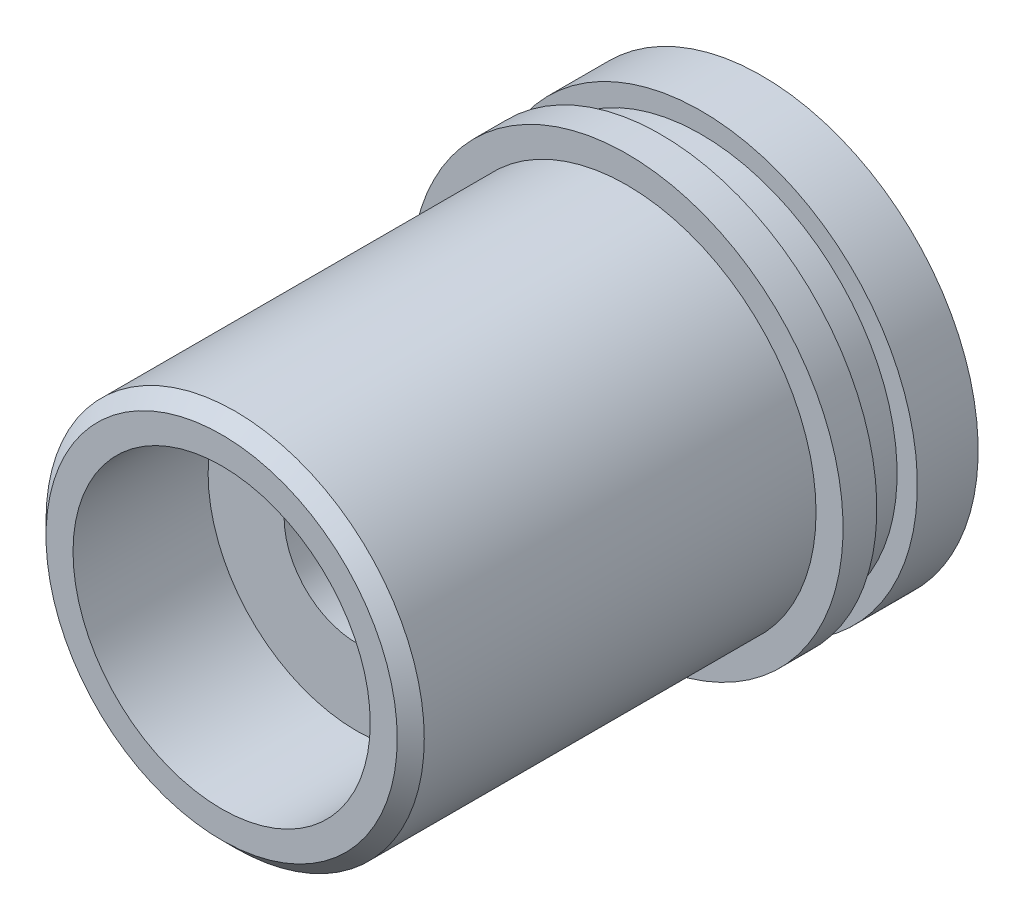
ISO-10303-21;
HEADER;
FILE_DESCRIPTION(('STEP AP214'),'2;1');
FILE_NAME('part.step','',(''),(''),'','','');
FILE_SCHEMA(('AUTOMOTIVE_DESIGN { 1 0 10303 214 1 1 1 1 }'));
ENDSEC;
DATA;
#1=APPLICATION_CONTEXT('core data for automotive mechanical design processes');
#2=APPLICATION_PROTOCOL_DEFINITION('international standard','automotive_design',2000,#1);
#3=PRODUCT_CONTEXT('',#1,'mechanical');
#4=PRODUCT('Part','Part','',(#3));
#5=PRODUCT_RELATED_PRODUCT_CATEGORY('part','',(#4));
#6=PRODUCT_DEFINITION_FORMATION('','',#4);
#7=PRODUCT_DEFINITION_CONTEXT('part definition',#1,'design');
#8=PRODUCT_DEFINITION('design','',#6,#7);
#9=PRODUCT_DEFINITION_SHAPE('','',#8);
#10=(LENGTH_UNIT() NAMED_UNIT(*) SI_UNIT(.MILLI.,.METRE.));
#11=(NAMED_UNIT(*) PLANE_ANGLE_UNIT() SI_UNIT($,.RADIAN.));
#12=(NAMED_UNIT(*) SI_UNIT($,.STERADIAN.) SOLID_ANGLE_UNIT());
#13=UNCERTAINTY_MEASURE_WITH_UNIT(LENGTH_MEASURE(1.E-05),#10,'distance_accuracy_value','');
#14=(GEOMETRIC_REPRESENTATION_CONTEXT(3) GLOBAL_UNCERTAINTY_ASSIGNED_CONTEXT((#13)) GLOBAL_UNIT_ASSIGNED_CONTEXT((#10,
#11,#12)) REPRESENTATION_CONTEXT('',''));
#15=CARTESIAN_POINT('',(0.,0.,0.));
#16=DIRECTION('',(0.,0.,1.));
#17=DIRECTION('',(1.,0.,0.));
#18=AXIS2_PLACEMENT_3D('',#15,#16,#17);
#19=CARTESIAN_POINT('',(0.,0.,20.));
#20=DIRECTION('',(0.,0.,-1.));
#21=DIRECTION('',(-1.,0.,0.));
#22=AXIS2_PLACEMENT_3D('',#19,#20,#21);
#23=CONICAL_SURFACE('',#22,5.37534009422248,0.08726646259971);
#24=CARTESIAN_POINT('',(0.,0.,-10.));
#25=DIRECTION('',(0.,0.,-1.));
#26=DIRECTION('',(-1.,0.,0.));
#27=AXIS2_PLACEMENT_3D('',#24,#25,#26);
#28=CIRCLE('',#27,8.);
#29=CARTESIAN_POINT('',(-8.,0.,-10.));
#30=VERTEX_POINT('',#29);
#31=EDGE_CURVE('E49',#30,#30,#28,.T.);
#32=ORIENTED_EDGE('',*,*,#31,.T.);
#33=EDGE_LOOP('',(#32));
#34=FACE_BOUND('',#33,.T.);
#35=CARTESIAN_POINT('',(0.,0.,20.));
#36=DIRECTION('',(0.,0.,-1.));
#37=DIRECTION('',(-1.,0.,0.));
#38=AXIS2_PLACEMENT_3D('',#35,#36,#37);
#39=CIRCLE('',#38,5.37534009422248);
#40=CARTESIAN_POINT('',(-5.37534009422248,0.,20.));
#41=VERTEX_POINT('',#40);
#42=EDGE_CURVE('E82',#41,#41,#39,.T.);
#43=ORIENTED_EDGE('',*,*,#42,.F.);
#44=EDGE_LOOP('',(#43));
#45=FACE_BOUND('',#44,.T.);
#46=ADVANCED_FACE('F39',(#34,#45),#23,.F.);
#47=CARTESIAN_POINT('',(-8.,0.,-10.));
#48=DIRECTION('',(0.,0.,-1.));
#49=DIRECTION('',(-1.,0.,0.));
#50=AXIS2_PLACEMENT_3D('',#47,#48,#49);
#51=PLANE('',#50);
#52=CARTESIAN_POINT('',(0.,0.,-10.));
#53=DIRECTION('',(0.,0.,-1.));
#54=DIRECTION('',(-1.,0.,0.));
#55=AXIS2_PLACEMENT_3D('',#52,#53,#54);
#56=CIRCLE('',#55,16.);
#57=CARTESIAN_POINT('',(-16.,0.,-10.));
#58=VERTEX_POINT('',#57);
#59=EDGE_CURVE('E53',#58,#58,#56,.T.);
#60=ORIENTED_EDGE('',*,*,#59,.T.);
#61=EDGE_LOOP('',(#60));
#62=FACE_BOUND('',#61,.T.);
#63=ORIENTED_EDGE('',*,*,#31,.F.);
#64=EDGE_LOOP('',(#63));
#65=FACE_BOUND('',#64,.T.);
#66=ADVANCED_FACE('F90',(#62,#65),#51,.T.);
#67=CARTESIAN_POINT('',(0.,0.,-11.0873015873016));
#68=DIRECTION('',(0.,0.,-1.));
#69=DIRECTION('',(-1.,0.,0.));
#70=AXIS2_PLACEMENT_3D('',#67,#68,#69);
#71=CYLINDRICAL_SURFACE('',#70,16.);
#72=CARTESIAN_POINT('',(0.,0.,-5.5));
#73=DIRECTION('',(0.,0.,-1.));
#74=DIRECTION('',(-1.,0.,0.));
#75=AXIS2_PLACEMENT_3D('',#72,#73,#74);
#76=CIRCLE('',#75,16.);
#77=CARTESIAN_POINT('',(-16.,0.,-5.5));
#78=VERTEX_POINT('',#77);
#79=EDGE_CURVE('E58',#78,#78,#76,.T.);
#80=ORIENTED_EDGE('',*,*,#79,.T.);
#81=EDGE_LOOP('',(#80));
#82=FACE_BOUND('',#81,.T.);
#83=ORIENTED_EDGE('',*,*,#59,.F.);
#84=EDGE_LOOP('',(#83));
#85=FACE_BOUND('',#84,.T.);
#86=ADVANCED_FACE('F95',(#82,#85),#71,.T.);
#87=CARTESIAN_POINT('',(-16.,0.,-5.5));
#88=DIRECTION('',(0.,0.,1.));
#89=DIRECTION('',(1.,0.,0.));
#90=AXIS2_PLACEMENT_3D('',#87,#88,#89);
#91=PLANE('',#90);
#92=CARTESIAN_POINT('',(0.,0.,-5.5));
#93=DIRECTION('',(0.,0.,-1.));
#94=DIRECTION('',(-1.,0.,0.));
#95=AXIS2_PLACEMENT_3D('',#92,#93,#94);
#96=CIRCLE('',#95,14.5);
#97=CARTESIAN_POINT('',(-14.5,0.,-5.5));
#98=VERTEX_POINT('',#97);
#99=EDGE_CURVE('E61',#98,#98,#96,.T.);
#100=ORIENTED_EDGE('',*,*,#99,.T.);
#101=EDGE_LOOP('',(#100));
#102=FACE_BOUND('',#101,.T.);
#103=ORIENTED_EDGE('',*,*,#79,.F.);
#104=EDGE_LOOP('',(#103));
#105=FACE_BOUND('',#104,.T.);
#106=ADVANCED_FACE('F102',(#102,#105),#91,.T.);
#107=CARTESIAN_POINT('',(0.,0.,-11.0873015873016));
#108=DIRECTION('',(0.,0.,-1.));
#109=DIRECTION('',(-1.,0.,0.));
#110=AXIS2_PLACEMENT_3D('',#107,#108,#109);
#111=CYLINDRICAL_SURFACE('',#110,14.5);
#112=CARTESIAN_POINT('',(0.,0.,-2.5));
#113=DIRECTION('',(0.,0.,-1.));
#114=DIRECTION('',(-1.,0.,0.));
#115=AXIS2_PLACEMENT_3D('',#112,#113,#114);
#116=CIRCLE('',#115,14.5);
#117=CARTESIAN_POINT('',(-14.5,0.,-2.5));
#118=VERTEX_POINT('',#117);
#119=EDGE_CURVE('E64',#118,#118,#116,.T.);
#120=ORIENTED_EDGE('',*,*,#119,.T.);
#121=EDGE_LOOP('',(#120));
#122=FACE_BOUND('',#121,.T.);
#123=ORIENTED_EDGE('',*,*,#99,.F.);
#124=EDGE_LOOP('',(#123));
#125=FACE_BOUND('',#124,.T.);
#126=ADVANCED_FACE('F108',(#122,#125),#111,.T.);
#127=CARTESIAN_POINT('',(-14.5,0.,-2.5));
#128=DIRECTION('',(0.,0.,-1.));
#129=DIRECTION('',(-1.,0.,0.));
#130=AXIS2_PLACEMENT_3D('',#127,#128,#129);
#131=PLANE('',#130);
#132=CARTESIAN_POINT('',(0.,0.,-2.5));
#133=DIRECTION('',(0.,0.,-1.));
#134=DIRECTION('',(-1.,0.,0.));
#135=AXIS2_PLACEMENT_3D('',#132,#133,#134);
#136=CIRCLE('',#135,16.);
#137=CARTESIAN_POINT('',(-16.,0.,-2.5));
#138=VERTEX_POINT('',#137);
#139=EDGE_CURVE('E67',#138,#138,#136,.T.);
#140=ORIENTED_EDGE('',*,*,#139,.T.);
#141=EDGE_LOOP('',(#140));
#142=FACE_BOUND('',#141,.T.);
#143=ORIENTED_EDGE('',*,*,#119,.F.);
#144=EDGE_LOOP('',(#143));
#145=FACE_BOUND('',#144,.T.);
#146=ADVANCED_FACE('F112',(#142,#145),#131,.T.);
#147=CARTESIAN_POINT('',(0.,0.,-11.0873015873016));
#148=DIRECTION('',(0.,0.,-1.));
#149=DIRECTION('',(-1.,0.,0.));
#150=AXIS2_PLACEMENT_3D('',#147,#148,#149);
#151=CYLINDRICAL_SURFACE('',#150,16.);
#152=CARTESIAN_POINT('',(0.,0.,0.));
#153=DIRECTION('',(0.,0.,-1.));
#154=DIRECTION('',(-1.,0.,0.));
#155=AXIS2_PLACEMENT_3D('',#152,#153,#154);
#156=CIRCLE('',#155,16.);
#157=CARTESIAN_POINT('',(-16.,0.,0.));
#158=VERTEX_POINT('',#157);
#159=EDGE_CURVE('E70',#158,#158,#156,.T.);
#160=ORIENTED_EDGE('',*,*,#159,.T.);
#161=EDGE_LOOP('',(#160));
#162=FACE_BOUND('',#161,.T.);
#163=ORIENTED_EDGE('',*,*,#139,.F.);
#164=EDGE_LOOP('',(#163));
#165=FACE_BOUND('',#164,.T.);
#166=ADVANCED_FACE('F116',(#162,#165),#151,.T.);
#167=CARTESIAN_POINT('',(-16.,0.,0.));
#168=DIRECTION('',(0.,0.,1.));
#169=DIRECTION('',(1.,0.,0.));
#170=AXIS2_PLACEMENT_3D('',#167,#168,#169);
#171=PLANE('',#170);
#172=CARTESIAN_POINT('',(0.,0.,0.));
#173=DIRECTION('',(0.,0.,-1.));
#174=DIRECTION('',(-1.,0.,0.));
#175=AXIS2_PLACEMENT_3D('',#172,#173,#174);
#176=CIRCLE('',#175,14.);
#177=CARTESIAN_POINT('',(-14.,0.,0.));
#178=VERTEX_POINT('',#177);
#179=EDGE_CURVE('E73',#178,#178,#176,.T.);
#180=ORIENTED_EDGE('',*,*,#179,.T.);
#181=EDGE_LOOP('',(#180));
#182=FACE_BOUND('',#181,.T.);
#183=ORIENTED_EDGE('',*,*,#159,.F.);
#184=EDGE_LOOP('',(#183));
#185=FACE_BOUND('',#184,.T.);
#186=ADVANCED_FACE('F120',(#182,#185),#171,.T.);
#187=CARTESIAN_POINT('',(0.,0.,-11.0873015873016));
#188=DIRECTION('',(0.,0.,-1.));
#189=DIRECTION('',(-1.,0.,0.));
#190=AXIS2_PLACEMENT_3D('',#187,#188,#189);
#191=CYLINDRICAL_SURFACE('',#190,14.);
#192=CARTESIAN_POINT('',(0.,0.,29.));
#193=DIRECTION('',(0.,0.,1.));
#194=DIRECTION('',(1.,0.,0.));
#195=AXIS2_PLACEMENT_3D('',#192,#193,#194);
#196=CIRCLE('',#195,14.);
#197=CARTESIAN_POINT('',(14.,0.,29.));
#198=VERTEX_POINT('',#197);
#199=EDGE_CURVE('E45',#198,#198,#196,.F.);
#200=ORIENTED_EDGE('',*,*,#199,.T.);
#201=EDGE_LOOP('',(#200));
#202=FACE_BOUND('',#201,.T.);
#203=ORIENTED_EDGE('',*,*,#179,.F.);
#204=EDGE_LOOP('',(#203));
#205=FACE_BOUND('',#204,.T.);
#206=ADVANCED_FACE('F124',(#202,#205),#191,.T.);
#207=CARTESIAN_POINT('',(-14.,0.,30.));
#208=DIRECTION('',(0.,0.,1.));
#209=DIRECTION('',(1.,0.,0.));
#210=AXIS2_PLACEMENT_3D('',#207,#208,#209);
#211=PLANE('',#210);
#212=CARTESIAN_POINT('',(0.,0.,30.));
#213=DIRECTION('',(0.,0.,1.));
#214=DIRECTION('',(1.,0.,0.));
#215=AXIS2_PLACEMENT_3D('',#212,#213,#214);
#216=CIRCLE('',#215,13.);
#217=CARTESIAN_POINT('',(13.,0.,30.));
#218=VERTEX_POINT('',#217);
#219=EDGE_CURVE('E10',#218,#218,#216,.T.);
#220=ORIENTED_EDGE('',*,*,#219,.T.);
#221=EDGE_LOOP('',(#220));
#222=FACE_BOUND('',#221,.T.);
#223=CARTESIAN_POINT('',(0.,0.,30.));
#224=DIRECTION('',(0.,0.,-1.));
#225=DIRECTION('',(-1.,0.,0.));
#226=AXIS2_PLACEMENT_3D('',#223,#224,#225);
#227=CIRCLE('',#226,11.);
#228=CARTESIAN_POINT('',(-11.,0.,30.));
#229=VERTEX_POINT('',#228);
#230=EDGE_CURVE('E76',#229,#229,#227,.T.);
#231=ORIENTED_EDGE('',*,*,#230,.T.);
#232=EDGE_LOOP('',(#231));
#233=FACE_BOUND('',#232,.T.);
#234=ADVANCED_FACE('F128',(#222,#233),#211,.T.);
#235=CARTESIAN_POINT('',(0.,0.,-11.0873015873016));
#236=DIRECTION('',(0.,0.,-1.));
#237=DIRECTION('',(-1.,0.,0.));
#238=AXIS2_PLACEMENT_3D('',#235,#236,#237);
#239=CYLINDRICAL_SURFACE('',#238,11.);
#240=CARTESIAN_POINT('',(0.,0.,20.));
#241=DIRECTION('',(0.,0.,-1.));
#242=DIRECTION('',(-1.,0.,0.));
#243=AXIS2_PLACEMENT_3D('',#240,#241,#242);
#244=CIRCLE('',#243,11.);
#245=CARTESIAN_POINT('',(-11.,0.,20.));
#246=VERTEX_POINT('',#245);
#247=EDGE_CURVE('E79',#246,#246,#244,.T.);
#248=ORIENTED_EDGE('',*,*,#247,.T.);
#249=EDGE_LOOP('',(#248));
#250=FACE_BOUND('',#249,.T.);
#251=ORIENTED_EDGE('',*,*,#230,.F.);
#252=EDGE_LOOP('',(#251));
#253=FACE_BOUND('',#252,.T.);
#254=ADVANCED_FACE('F131',(#250,#253),#239,.F.);
#255=CARTESIAN_POINT('',(-11.,0.,20.));
#256=DIRECTION('',(0.,0.,1.));
#257=DIRECTION('',(1.,0.,0.));
#258=AXIS2_PLACEMENT_3D('',#255,#256,#257);
#259=PLANE('',#258);
#260=ORIENTED_EDGE('',*,*,#42,.T.);
#261=EDGE_LOOP('',(#260));
#262=FACE_BOUND('',#261,.T.);
#263=ORIENTED_EDGE('',*,*,#247,.F.);
#264=EDGE_LOOP('',(#263));
#265=FACE_BOUND('',#264,.T.);
#266=ADVANCED_FACE('F86',(#262,#265),#259,.T.);
#267=CARTESIAN_POINT('',(0.,0.,29.));
#268=DIRECTION('',(0.,0.,-1.));
#269=DIRECTION('',(-1.,0.,0.));
#270=AXIS2_PLACEMENT_3D('',#267,#268,#269);
#271=CONICAL_SURFACE('',#270,14.,0.785398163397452);
#272=ORIENTED_EDGE('',*,*,#219,.F.);
#273=EDGE_LOOP('',(#272));
#274=FACE_BOUND('',#273,.T.);
#275=ORIENTED_EDGE('',*,*,#199,.F.);
#276=EDGE_LOOP('',(#275));
#277=FACE_BOUND('',#276,.T.);
#278=ADVANCED_FACE('F137',(#274,#277),#271,.T.);
#279=CLOSED_SHELL('',(#46,#66,#86,#106,#126,#146,#166,#186,#206,#234,#254,#266,#278));
#280=MANIFOLD_SOLID_BREP('B2',#279);
#281=ADVANCED_BREP_SHAPE_REPRESENTATION('',(#18,#280),#14);
#282=SHAPE_DEFINITION_REPRESENTATION(#9,#281);
ENDSEC;
END-ISO-10303-21;
